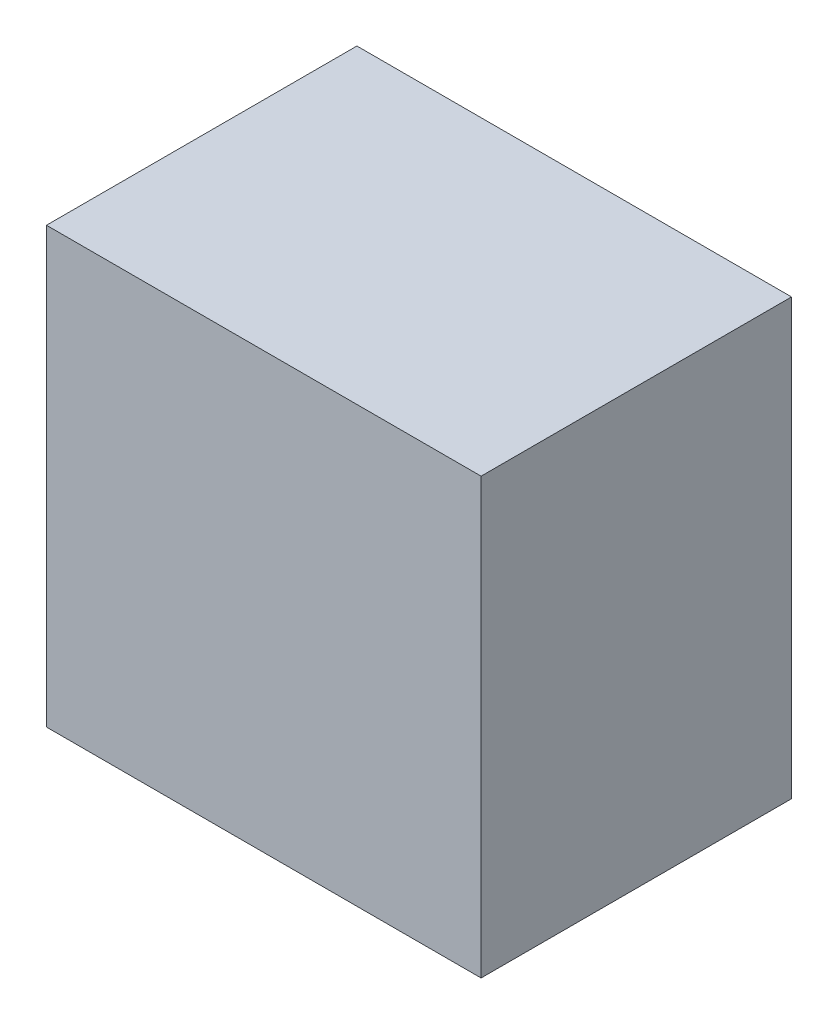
ISO-10303-21;
HEADER;
FILE_DESCRIPTION(('STEP AP214'),'2;1');
FILE_NAME('part.step','',(''),(''),'','','');
FILE_SCHEMA(('AUTOMOTIVE_DESIGN { 1 0 10303 214 1 1 1 1 }'));
ENDSEC;
DATA;
#1=APPLICATION_CONTEXT('core data for automotive mechanical design processes');
#2=APPLICATION_PROTOCOL_DEFINITION('international standard','automotive_design',2000,#1);
#3=PRODUCT_CONTEXT('',#1,'mechanical');
#4=PRODUCT('Part','Part','',(#3));
#5=PRODUCT_RELATED_PRODUCT_CATEGORY('part','',(#4));
#6=PRODUCT_DEFINITION_FORMATION('','',#4);
#7=PRODUCT_DEFINITION_CONTEXT('part definition',#1,'design');
#8=PRODUCT_DEFINITION('design','',#6,#7);
#9=PRODUCT_DEFINITION_SHAPE('','',#8);
#10=(LENGTH_UNIT() NAMED_UNIT(*) SI_UNIT(.MILLI.,.METRE.));
#11=(NAMED_UNIT(*) PLANE_ANGLE_UNIT() SI_UNIT($,.RADIAN.));
#12=(NAMED_UNIT(*) SI_UNIT($,.STERADIAN.) SOLID_ANGLE_UNIT());
#13=UNCERTAINTY_MEASURE_WITH_UNIT(LENGTH_MEASURE(1.E-05),#10,'distance_accuracy_value','');
#14=(GEOMETRIC_REPRESENTATION_CONTEXT(3) GLOBAL_UNCERTAINTY_ASSIGNED_CONTEXT((#13)) GLOBAL_UNIT_ASSIGNED_CONTEXT((#10,
#11,#12)) REPRESENTATION_CONTEXT('',''));
#15=CARTESIAN_POINT('',(0.,0.,0.));
#16=DIRECTION('',(0.,0.,1.));
#17=DIRECTION('',(1.,0.,0.));
#18=AXIS2_PLACEMENT_3D('',#15,#16,#17);
#19=CARTESIAN_POINT('',(2.10000124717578,-2.10000051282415,0.));
#20=DIRECTION('',(1.74845553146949E-07,-0.999999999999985,0.));
#21=DIRECTION('',(-0.999999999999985,-1.74845553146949E-07,0.));
#22=AXIS2_PLACEMENT_3D('',#19,#20,#21);
#23=PLANE('',#22);
#24=DIRECTION('',(0.,0.,1.));
#25=VECTOR('',#24,1.);
#26=CARTESIAN_POINT('',(2.10000124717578,-2.10000051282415,0.));
#27=LINE('',#26,#25);
#28=CARTESIAN_POINT('',(2.10000124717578,-2.10000051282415,0.));
#29=VERTEX_POINT('',#28);
#30=CARTESIAN_POINT('',(2.10000124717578,-2.10000051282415,2.99999908));
#31=VERTEX_POINT('',#30);
#32=EDGE_CURVE('E11',#29,#31,#27,.T.);
#33=ORIENTED_EDGE('',*,*,#32,.T.);
#34=DIRECTION('',(-0.999999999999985,-1.74845553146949E-07,0.));
#35=VECTOR('',#34,1.);
#36=CARTESIAN_POINT('',(2.10000124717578,-2.10000051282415,2.99999908));
#37=LINE('',#36,#35);
#38=CARTESIAN_POINT('',(-2.10000051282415,-2.10000124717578,2.99999908));
#39=VERTEX_POINT('',#38);
#40=EDGE_CURVE('E24',#31,#39,#37,.T.);
#41=ORIENTED_EDGE('',*,*,#40,.T.);
#42=DIRECTION('',(0.,0.,1.));
#43=VECTOR('',#42,1.);
#44=CARTESIAN_POINT('',(-2.10000051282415,-2.10000124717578,0.));
#45=LINE('',#44,#43);
#46=CARTESIAN_POINT('',(-2.10000051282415,-2.10000124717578,0.));
#47=VERTEX_POINT('',#46);
#48=EDGE_CURVE('E85',#47,#39,#45,.T.);
#49=ORIENTED_EDGE('',*,*,#48,.F.);
#50=DIRECTION('',(-0.999999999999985,-1.74845553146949E-07,0.));
#51=VECTOR('',#50,1.);
#52=CARTESIAN_POINT('',(2.10000124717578,-2.10000051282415,0.));
#53=LINE('',#52,#51);
#54=EDGE_CURVE('E83',#29,#47,#53,.T.);
#55=ORIENTED_EDGE('',*,*,#54,.F.);
#56=EDGE_LOOP('',(#33,#41,#49,#55));
#57=FACE_BOUND('',#56,.T.);
#58=ADVANCED_FACE('F17',(#57),#23,.T.);
#59=CARTESIAN_POINT('',(-2.10000051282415,-2.10000124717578,0.));
#60=DIRECTION('',(-0.999999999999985,-1.74845553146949E-07,0.));
#61=DIRECTION('',(-1.74845553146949E-07,0.999999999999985,0.));
#62=AXIS2_PLACEMENT_3D('',#59,#60,#61);
#63=PLANE('',#62);
#64=ORIENTED_EDGE('',*,*,#48,.T.);
#65=DIRECTION('',(-1.74845553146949E-07,0.999999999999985,0.));
#66=VECTOR('',#65,1.);
#67=CARTESIAN_POINT('',(-2.10000051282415,-2.10000124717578,2.99999908));
#68=LINE('',#67,#66);
#69=CARTESIAN_POINT('',(-2.10000124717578,2.10000051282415,2.99999908));
#70=VERTEX_POINT('',#69);
#71=EDGE_CURVE('E81',#39,#70,#68,.T.);
#72=ORIENTED_EDGE('',*,*,#71,.T.);
#73=DIRECTION('',(0.,0.,1.));
#74=VECTOR('',#73,1.);
#75=CARTESIAN_POINT('',(-2.10000124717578,2.10000051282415,0.));
#76=LINE('',#75,#74);
#77=CARTESIAN_POINT('',(-2.10000124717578,2.10000051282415,0.));
#78=VERTEX_POINT('',#77);
#79=EDGE_CURVE('E79',#78,#70,#76,.T.);
#80=ORIENTED_EDGE('',*,*,#79,.F.);
#81=DIRECTION('',(-1.74845553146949E-07,0.999999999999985,0.));
#82=VECTOR('',#81,1.);
#83=CARTESIAN_POINT('',(-2.10000051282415,-2.10000124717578,0.));
#84=LINE('',#83,#82);
#85=EDGE_CURVE('E61',#47,#78,#84,.T.);
#86=ORIENTED_EDGE('',*,*,#85,.F.);
#87=EDGE_LOOP('',(#64,#72,#80,#86));
#88=FACE_BOUND('',#87,.T.);
#89=ADVANCED_FACE('F90',(#88),#63,.T.);
#90=CARTESIAN_POINT('',(-2.10000124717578,2.10000051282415,0.));
#91=DIRECTION('',(-1.74845553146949E-07,0.999999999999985,0.));
#92=DIRECTION('',(0.999999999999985,1.74845553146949E-07,0.));
#93=AXIS2_PLACEMENT_3D('',#90,#91,#92);
#94=PLANE('',#93);
#95=ORIENTED_EDGE('',*,*,#79,.T.);
#96=DIRECTION('',(0.999999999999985,1.74845553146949E-07,0.));
#97=VECTOR('',#96,1.);
#98=CARTESIAN_POINT('',(-2.10000124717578,2.10000051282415,2.99999908));
#99=LINE('',#98,#97);
#100=CARTESIAN_POINT('',(2.10000051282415,2.10000124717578,2.99999908));
#101=VERTEX_POINT('',#100);
#102=EDGE_CURVE('E70',#70,#101,#99,.T.);
#103=ORIENTED_EDGE('',*,*,#102,.T.);
#104=DIRECTION('',(0.,0.,1.));
#105=VECTOR('',#104,1.);
#106=CARTESIAN_POINT('',(2.10000051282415,2.10000124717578,0.));
#107=LINE('',#106,#105);
#108=CARTESIAN_POINT('',(2.10000051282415,2.10000124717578,0.));
#109=VERTEX_POINT('',#108);
#110=EDGE_CURVE('E64',#109,#101,#107,.T.);
#111=ORIENTED_EDGE('',*,*,#110,.F.);
#112=DIRECTION('',(0.999999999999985,1.74845553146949E-07,0.));
#113=VECTOR('',#112,1.);
#114=CARTESIAN_POINT('',(-2.10000124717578,2.10000051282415,0.));
#115=LINE('',#114,#113);
#116=EDGE_CURVE('E55',#78,#109,#115,.T.);
#117=ORIENTED_EDGE('',*,*,#116,.F.);
#118=EDGE_LOOP('',(#95,#103,#111,#117));
#119=FACE_BOUND('',#118,.T.);
#120=ADVANCED_FACE('F68',(#119),#94,.T.);
#121=CARTESIAN_POINT('',(2.10000051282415,2.10000124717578,0.));
#122=DIRECTION('',(0.999999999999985,1.74845553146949E-07,0.));
#123=DIRECTION('',(1.74845553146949E-07,-0.999999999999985,0.));
#124=AXIS2_PLACEMENT_3D('',#121,#122,#123);
#125=PLANE('',#124);
#126=ORIENTED_EDGE('',*,*,#110,.T.);
#127=DIRECTION('',(1.74845553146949E-07,-0.999999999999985,0.));
#128=VECTOR('',#127,1.);
#129=CARTESIAN_POINT('',(2.10000051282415,2.10000124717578,2.99999908));
#130=LINE('',#129,#128);
#131=EDGE_CURVE('E65',#101,#31,#130,.T.);
#132=ORIENTED_EDGE('',*,*,#131,.T.);
#133=ORIENTED_EDGE('',*,*,#32,.F.);
#134=DIRECTION('',(1.74845553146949E-07,-0.999999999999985,0.));
#135=VECTOR('',#134,1.);
#136=CARTESIAN_POINT('',(2.10000051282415,2.10000124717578,0.));
#137=LINE('',#136,#135);
#138=EDGE_CURVE('E59',#109,#29,#137,.T.);
#139=ORIENTED_EDGE('',*,*,#138,.F.);
#140=EDGE_LOOP('',(#126,#132,#133,#139));
#141=FACE_BOUND('',#140,.T.);
#142=ADVANCED_FACE('F73',(#141),#125,.T.);
#143=CARTESIAN_POINT('',(2.10000124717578,-2.10000051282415,0.));
#144=DIRECTION('',(0.,0.,1.));
#145=DIRECTION('',(0.999999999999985,1.74845553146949E-07,0.));
#146=AXIS2_PLACEMENT_3D('',#143,#144,#145);
#147=PLANE('',#146);
#148=ORIENTED_EDGE('',*,*,#54,.T.);
#149=ORIENTED_EDGE('',*,*,#85,.T.);
#150=ORIENTED_EDGE('',*,*,#116,.T.);
#151=ORIENTED_EDGE('',*,*,#138,.T.);
#152=EDGE_LOOP('',(#148,#149,#150,#151));
#153=FACE_BOUND('',#152,.T.);
#154=ADVANCED_FACE('F58',(#153),#147,.F.);
#155=CARTESIAN_POINT('',(2.10000124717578,-2.10000051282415,2.99999908));
#156=DIRECTION('',(0.,0.,1.));
#157=DIRECTION('',(0.999999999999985,1.74845553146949E-07,0.));
#158=AXIS2_PLACEMENT_3D('',#155,#156,#157);
#159=PLANE('',#158);
#160=ORIENTED_EDGE('',*,*,#131,.F.);
#161=ORIENTED_EDGE('',*,*,#102,.F.);
#162=ORIENTED_EDGE('',*,*,#71,.F.);
#163=ORIENTED_EDGE('',*,*,#40,.F.);
#164=EDGE_LOOP('',(#160,#161,#162,#163));
#165=FACE_BOUND('',#164,.T.);
#166=ADVANCED_FACE('F91',(#165),#159,.T.);
#167=CLOSED_SHELL('',(#58,#89,#120,#142,#154,#166));
#168=MANIFOLD_SOLID_BREP('B1',#167);
#169=ADVANCED_BREP_SHAPE_REPRESENTATION('',(#18,#168),#14);
#170=SHAPE_DEFINITION_REPRESENTATION(#9,#169);
ENDSEC;
END-ISO-10303-21;
